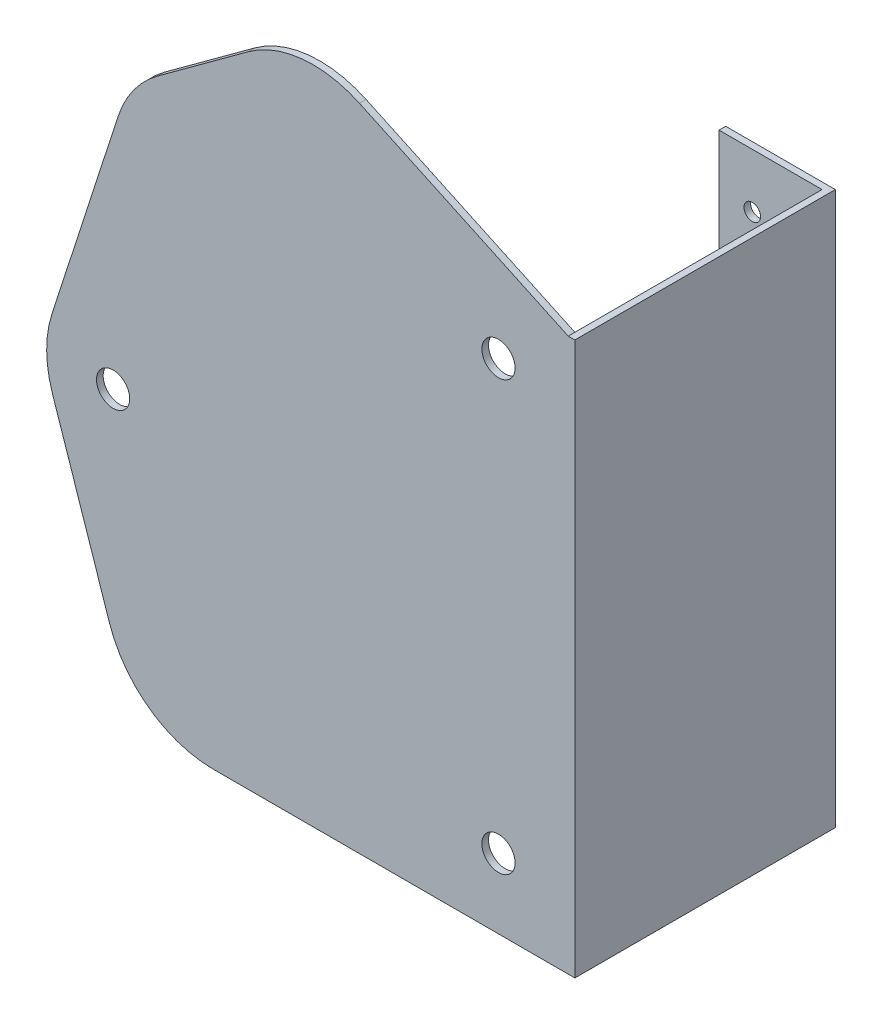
ISO-10303-21;
HEADER;
FILE_DESCRIPTION(('STEP AP214'),'2;1');
FILE_NAME('part.step','',(''),(''),'','','');
FILE_SCHEMA(('AUTOMOTIVE_DESIGN { 1 0 10303 214 1 1 1 1 }'));
ENDSEC;
DATA;
#1=APPLICATION_CONTEXT('core data for automotive mechanical design processes');
#2=APPLICATION_PROTOCOL_DEFINITION('international standard','automotive_design',2000,#1);
#3=PRODUCT_CONTEXT('',#1,'mechanical');
#4=PRODUCT('Part','Part','',(#3));
#5=PRODUCT_RELATED_PRODUCT_CATEGORY('part','',(#4));
#6=PRODUCT_DEFINITION_FORMATION('','',#4);
#7=PRODUCT_DEFINITION_CONTEXT('part definition',#1,'design');
#8=PRODUCT_DEFINITION('design','',#6,#7);
#9=PRODUCT_DEFINITION_SHAPE('','',#8);
#10=(LENGTH_UNIT() NAMED_UNIT(*) SI_UNIT(.MILLI.,.METRE.));
#11=(NAMED_UNIT(*) PLANE_ANGLE_UNIT() SI_UNIT($,.RADIAN.));
#12=(NAMED_UNIT(*) SI_UNIT($,.STERADIAN.) SOLID_ANGLE_UNIT());
#13=UNCERTAINTY_MEASURE_WITH_UNIT(LENGTH_MEASURE(1.E-05),#10,'distance_accuracy_value','');
#14=(GEOMETRIC_REPRESENTATION_CONTEXT(3) GLOBAL_UNCERTAINTY_ASSIGNED_CONTEXT((#13)) GLOBAL_UNIT_ASSIGNED_CONTEXT((#10,
#11,#12)) REPRESENTATION_CONTEXT('',''));
#15=CARTESIAN_POINT('',(0.,0.,0.));
#16=DIRECTION('',(0.,0.,1.));
#17=DIRECTION('',(1.,0.,0.));
#18=AXIS2_PLACEMENT_3D('',#15,#16,#17);
#19=CARTESIAN_POINT('',(0.,166.333882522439,-76.4));
#20=DIRECTION('',(-1.,0.,0.));
#21=DIRECTION('',(0.,0.,1.));
#22=AXIS2_PLACEMENT_3D('',#19,#20,#21);
#23=PLANE('',#22);
#24=DIRECTION('',(0.,0.,1.));
#25=VECTOR('',#24,1.);
#26=CARTESIAN_POINT('',(0.,166.333882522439,-76.4));
#27=LINE('',#26,#25);
#28=CARTESIAN_POINT('',(0.,166.333882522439,-74.4));
#29=VERTEX_POINT('',#28);
#30=CARTESIAN_POINT('',(0.,166.333882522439,0.));
#31=VERTEX_POINT('',#30);
#32=EDGE_CURVE('E57',#29,#31,#27,.T.);
#33=ORIENTED_EDGE('',*,*,#32,.F.);
#34=DIRECTION('',(0.,1.,0.));
#35=VECTOR('',#34,1.);
#36=CARTESIAN_POINT('',(0.,0.,-74.4));
#37=LINE('',#36,#35);
#38=CARTESIAN_POINT('',(0.,0.,-74.4));
#39=VERTEX_POINT('',#38);
#40=EDGE_CURVE('E52',#39,#29,#37,.T.);
#41=ORIENTED_EDGE('',*,*,#40,.F.);
#42=DIRECTION('',(0.,0.,1.));
#43=VECTOR('',#42,1.);
#44=CARTESIAN_POINT('',(0.,0.,-76.4));
#45=LINE('',#44,#43);
#46=CARTESIAN_POINT('',(0.,0.,0.));
#47=VERTEX_POINT('',#46);
#48=EDGE_CURVE('E38',#39,#47,#45,.T.);
#49=ORIENTED_EDGE('',*,*,#48,.T.);
#50=DIRECTION('',(0.,1.,0.));
#51=VECTOR('',#50,1.);
#52=CARTESIAN_POINT('',(0.,0.,0.));
#53=LINE('',#52,#51);
#54=EDGE_CURVE('E197',#47,#31,#53,.T.);
#55=ORIENTED_EDGE('',*,*,#54,.T.);
#56=EDGE_LOOP('',(#33,#41,#49,#55));
#57=FACE_BOUND('',#56,.T.);
#58=ADVANCED_FACE('F34',(#57),#23,.T.);
#59=CARTESIAN_POINT('',(-19.0672172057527,175.214504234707,2.));
#60=DIRECTION('',(-0.422205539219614,-0.906500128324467,0.));
#61=DIRECTION('',(0.906500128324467,-0.422205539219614,0.));
#62=AXIS2_PLACEMENT_3D('',#59,#60,#61);
#63=PLANE('',#62);
#64=DIRECTION('',(-0.906500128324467,0.422205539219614,0.));
#65=VECTOR('',#64,1.);
#66=CARTESIAN_POINT('',(-19.0672172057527,175.214504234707,0.));
#67=LINE('',#66,#65);
#68=CARTESIAN_POINT('',(-62.8672172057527,195.614504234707,0.));
#69=VERTEX_POINT('',#68);
#70=EDGE_CURVE('E201',#31,#69,#67,.T.);
#71=ORIENTED_EDGE('',*,*,#70,.T.);
#72=DIRECTION('',(0.,0.,-1.));
#73=VECTOR('',#72,1.);
#74=CARTESIAN_POINT('',(-62.8672172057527,195.614504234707,2.));
#75=LINE('',#74,#73);
#76=CARTESIAN_POINT('',(-62.8672172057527,195.614504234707,2.));
#77=VERTEX_POINT('',#76);
#78=EDGE_CURVE('E44',#77,#69,#75,.T.);
#79=ORIENTED_EDGE('',*,*,#78,.F.);
#80=DIRECTION('',(-0.906500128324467,0.422205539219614,0.));
#81=VECTOR('',#80,1.);
#82=CARTESIAN_POINT('',(0.,166.333882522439,2.));
#83=LINE('',#82,#81);
#84=CARTESIAN_POINT('',(0.,166.333882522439,2.));
#85=VERTEX_POINT('',#84);
#86=EDGE_CURVE('E207',#85,#77,#83,.T.);
#87=ORIENTED_EDGE('',*,*,#86,.F.);
#88=DIRECTION('',(0.,0.,-1.));
#89=VECTOR('',#88,1.);
#90=CARTESIAN_POINT('',(0.,166.333882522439,2.));
#91=LINE('',#90,#89);
#92=EDGE_CURVE('E11',#85,#31,#91,.T.);
#93=ORIENTED_EDGE('',*,*,#92,.T.);
#94=EDGE_LOOP('',(#71,#79,#87,#93));
#95=FACE_BOUND('',#94,.T.);
#96=ADVANCED_FACE('F36',(#95),#63,.F.);
#97=CARTESIAN_POINT('',(-76.8,165.7,2.));
#98=DIRECTION('',(0.,0.,-1.));
#99=DIRECTION('',(-1.,0.,0.));
#100=AXIS2_PLACEMENT_3D('',#97,#98,#99);
#101=CYLINDRICAL_SURFACE('',#100,33.);
#102=CARTESIAN_POINT('',(-76.8,165.7,0.));
#103=DIRECTION('',(0.,0.,1.));
#104=DIRECTION('',(1.,0.,0.));
#105=AXIS2_PLACEMENT_3D('',#102,#103,#104);
#106=CIRCLE('',#105,33.);
#107=CARTESIAN_POINT('',(-96.3023165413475,192.320662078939,0.));
#108=VERTEX_POINT('',#107);
#109=EDGE_CURVE('E203',#69,#108,#106,.T.);
#110=ORIENTED_EDGE('',*,*,#109,.T.);
#111=DIRECTION('',(0.,0.,-1.));
#112=VECTOR('',#111,1.);
#113=CARTESIAN_POINT('',(-96.3023165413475,192.320662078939,2.));
#114=LINE('',#113,#112);
#115=CARTESIAN_POINT('',(-96.3023165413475,192.320662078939,2.));
#116=VERTEX_POINT('',#115);
#117=EDGE_CURVE('E232',#116,#108,#114,.T.);
#118=ORIENTED_EDGE('',*,*,#117,.F.);
#119=CARTESIAN_POINT('',(-76.8,165.7,2.));
#120=DIRECTION('',(0.,0.,1.));
#121=DIRECTION('',(1.,0.,0.));
#122=AXIS2_PLACEMENT_3D('',#119,#120,#121);
#123=CIRCLE('',#122,33.);
#124=EDGE_CURVE('E242',#77,#116,#123,.T.);
#125=ORIENTED_EDGE('',*,*,#124,.F.);
#126=ORIENTED_EDGE('',*,*,#78,.T.);
#127=EDGE_LOOP('',(#110,#118,#125,#126));
#128=FACE_BOUND('',#127,.T.);
#129=ADVANCED_FACE('F240',(#128),#101,.T.);
#130=CARTESIAN_POINT('',(-96.3023165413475,192.320662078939,2.));
#131=DIRECTION('',(0.590979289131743,-0.806686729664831,0.));
#132=DIRECTION('',(0.806686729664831,0.590979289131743,0.));
#133=AXIS2_PLACEMENT_3D('',#130,#131,#132);
#134=PLANE('',#133);
#135=DIRECTION('',(-0.80668672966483,-0.590979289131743,0.));
#136=VECTOR('',#135,1.);
#137=CARTESIAN_POINT('',(-96.3023165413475,192.320662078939,0.));
#138=LINE('',#137,#136);
#139=CARTESIAN_POINT('',(-123.602316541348,172.320662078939,0.));
#140=VERTEX_POINT('',#139);
#141=EDGE_CURVE('E250',#108,#140,#138,.T.);
#142=ORIENTED_EDGE('',*,*,#141,.T.);
#143=DIRECTION('',(0.,0.,-1.));
#144=VECTOR('',#143,1.);
#145=CARTESIAN_POINT('',(-123.602316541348,172.320662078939,2.));
#146=LINE('',#145,#144);
#147=CARTESIAN_POINT('',(-123.602316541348,172.320662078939,2.));
#148=VERTEX_POINT('',#147);
#149=EDGE_CURVE('E229',#148,#140,#146,.T.);
#150=ORIENTED_EDGE('',*,*,#149,.F.);
#151=DIRECTION('',(-0.80668672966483,-0.590979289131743,0.));
#152=VECTOR('',#151,1.);
#153=CARTESIAN_POINT('',(-96.3023165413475,192.320662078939,2.));
#154=LINE('',#153,#152);
#155=EDGE_CURVE('E294',#116,#148,#154,.T.);
#156=ORIENTED_EDGE('',*,*,#155,.F.);
#157=ORIENTED_EDGE('',*,*,#117,.T.);
#158=EDGE_LOOP('',(#142,#150,#156,#157));
#159=FACE_BOUND('',#158,.T.);
#160=ADVANCED_FACE('F314',(#159),#134,.F.);
#161=CARTESIAN_POINT('',(-104.1,145.7,2.));
#162=DIRECTION('',(0.,0.,-1.));
#163=DIRECTION('',(-1.,0.,0.));
#164=AXIS2_PLACEMENT_3D('',#161,#162,#163);
#165=CYLINDRICAL_SURFACE('',#164,33.);
#166=CARTESIAN_POINT('',(-104.1,145.7,0.));
#167=DIRECTION('',(0.,0.,1.));
#168=DIRECTION('',(1.,0.,0.));
#169=AXIS2_PLACEMENT_3D('',#166,#167,#168);
#170=CIRCLE('',#169,33.);
#171=CARTESIAN_POINT('',(-135.492379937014,155.874403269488,0.));
#172=VERTEX_POINT('',#171);
#173=EDGE_CURVE('E252',#140,#172,#170,.T.);
#174=ORIENTED_EDGE('',*,*,#173,.T.);
#175=DIRECTION('',(0.,0.,-1.));
#176=VECTOR('',#175,1.);
#177=CARTESIAN_POINT('',(-135.492379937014,155.874403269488,2.));
#178=LINE('',#177,#176);
#179=CARTESIAN_POINT('',(-135.492379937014,155.874403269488,2.));
#180=VERTEX_POINT('',#179);
#181=EDGE_CURVE('E226',#180,#172,#178,.T.);
#182=ORIENTED_EDGE('',*,*,#181,.F.);
#183=CARTESIAN_POINT('',(-104.1,145.7,2.));
#184=DIRECTION('',(0.,0.,1.));
#185=DIRECTION('',(1.,0.,0.));
#186=AXIS2_PLACEMENT_3D('',#183,#184,#185);
#187=CIRCLE('',#186,33.);
#188=EDGE_CURVE('E296',#148,#180,#187,.T.);
#189=ORIENTED_EDGE('',*,*,#188,.F.);
#190=ORIENTED_EDGE('',*,*,#149,.T.);
#191=EDGE_LOOP('',(#174,#182,#189,#190));
#192=FACE_BOUND('',#191,.T.);
#193=ADVANCED_FACE('F318',(#192),#165,.T.);
#194=CARTESIAN_POINT('',(-135.492379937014,155.874403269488,2.));
#195=DIRECTION('',(0.95128424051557,-0.308315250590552,0.));
#196=DIRECTION('',(0.308315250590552,0.95128424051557,0.));
#197=AXIS2_PLACEMENT_3D('',#194,#195,#196);
#198=PLANE('',#197);
#199=DIRECTION('',(-0.308315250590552,-0.95128424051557,0.));
#200=VECTOR('',#199,1.);
#201=CARTESIAN_POINT('',(-135.492379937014,155.874403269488,0.));
#202=LINE('',#201,#200);
#203=CARTESIAN_POINT('',(-155.392379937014,94.4744032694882,0.));
#204=VERTEX_POINT('',#203);
#205=EDGE_CURVE('E258',#172,#204,#202,.T.);
#206=ORIENTED_EDGE('',*,*,#205,.T.);
#207=DIRECTION('',(0.,0.,-1.));
#208=VECTOR('',#207,1.);
#209=CARTESIAN_POINT('',(-155.392379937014,94.4744032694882,2.));
#210=LINE('',#209,#208);
#211=CARTESIAN_POINT('',(-155.392379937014,94.4744032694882,2.));
#212=VERTEX_POINT('',#211);
#213=EDGE_CURVE('E223',#212,#204,#210,.T.);
#214=ORIENTED_EDGE('',*,*,#213,.F.);
#215=DIRECTION('',(-0.308315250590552,-0.95128424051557,0.));
#216=VECTOR('',#215,1.);
#217=CARTESIAN_POINT('',(-135.492379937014,155.874403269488,2.));
#218=LINE('',#217,#216);
#219=EDGE_CURVE('E298',#180,#212,#218,.T.);
#220=ORIENTED_EDGE('',*,*,#219,.F.);
#221=ORIENTED_EDGE('',*,*,#181,.T.);
#222=EDGE_LOOP('',(#206,#214,#220,#221));
#223=FACE_BOUND('',#222,.T.);
#224=ADVANCED_FACE('F324',(#223),#198,.F.);
#225=CARTESIAN_POINT('',(-124.,84.3,2.));
#226=DIRECTION('',(0.,0.,-1.));
#227=DIRECTION('',(-1.,0.,0.));
#228=AXIS2_PLACEMENT_3D('',#225,#226,#227);
#229=CYLINDRICAL_SURFACE('',#228,33.);
#230=CARTESIAN_POINT('',(-124.,84.3,0.));
#231=DIRECTION('',(0.,0.,1.));
#232=DIRECTION('',(1.,0.,0.));
#233=AXIS2_PLACEMENT_3D('',#230,#231,#232);
#234=CIRCLE('',#233,33.);
#235=CARTESIAN_POINT('',(-155.288203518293,73.8096081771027,0.));
#236=VERTEX_POINT('',#235);
#237=EDGE_CURVE('E260',#204,#236,#234,.T.);
#238=ORIENTED_EDGE('',*,*,#237,.T.);
#239=DIRECTION('',(0.,0.,-1.));
#240=VECTOR('',#239,1.);
#241=CARTESIAN_POINT('',(-155.288203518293,73.8096081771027,2.));
#242=LINE('',#241,#240);
#243=CARTESIAN_POINT('',(-155.288203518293,73.8096081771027,2.));
#244=VERTEX_POINT('',#243);
#245=EDGE_CURVE('E220',#244,#236,#242,.T.);
#246=ORIENTED_EDGE('',*,*,#245,.F.);
#247=CARTESIAN_POINT('',(-124.,84.3,2.));
#248=DIRECTION('',(0.,0.,1.));
#249=DIRECTION('',(1.,0.,0.));
#250=AXIS2_PLACEMENT_3D('',#247,#248,#249);
#251=CIRCLE('',#250,33.);
#252=EDGE_CURVE('E300',#212,#244,#251,.T.);
#253=ORIENTED_EDGE('',*,*,#252,.F.);
#254=ORIENTED_EDGE('',*,*,#213,.T.);
#255=EDGE_LOOP('',(#238,#246,#253,#254));
#256=FACE_BOUND('',#255,.T.);
#257=ADVANCED_FACE('F328',(#256),#229,.T.);
#258=CARTESIAN_POINT('',(-155.288203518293,73.8096081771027,2.));
#259=DIRECTION('',(0.948127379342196,0.317890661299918,0.));
#260=DIRECTION('',(-0.317890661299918,0.948127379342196,0.));
#261=AXIS2_PLACEMENT_3D('',#258,#259,#260);
#262=PLANE('',#261);
#263=DIRECTION('',(0.317890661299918,-0.948127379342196,0.));
#264=VECTOR('',#263,1.);
#265=CARTESIAN_POINT('',(-155.288203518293,73.8096081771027,0.));
#266=LINE('',#265,#264);
#267=CARTESIAN_POINT('',(-138.088203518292,22.5096081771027,0.));
#268=VERTEX_POINT('',#267);
#269=EDGE_CURVE('E261',#236,#268,#266,.T.);
#270=ORIENTED_EDGE('',*,*,#269,.T.);
#271=DIRECTION('',(0.,0.,-1.));
#272=VECTOR('',#271,1.);
#273=CARTESIAN_POINT('',(-138.088203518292,22.5096081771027,2.));
#274=LINE('',#273,#272);
#275=CARTESIAN_POINT('',(-138.088203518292,22.5096081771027,2.));
#276=VERTEX_POINT('',#275);
#277=EDGE_CURVE('E216',#276,#268,#274,.T.);
#278=ORIENTED_EDGE('',*,*,#277,.F.);
#279=DIRECTION('',(0.317890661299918,-0.948127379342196,0.));
#280=VECTOR('',#279,1.);
#281=CARTESIAN_POINT('',(-155.288203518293,73.8096081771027,2.));
#282=LINE('',#281,#280);
#283=EDGE_CURVE('E302',#244,#276,#282,.T.);
#284=ORIENTED_EDGE('',*,*,#283,.F.);
#285=ORIENTED_EDGE('',*,*,#245,.T.);
#286=EDGE_LOOP('',(#270,#278,#284,#285));
#287=FACE_BOUND('',#286,.T.);
#288=ADVANCED_FACE('F330',(#287),#262,.F.);
#289=CARTESIAN_POINT('',(-106.8,33.,2.));
#290=DIRECTION('',(0.,0.,-1.));
#291=DIRECTION('',(-1.,0.,0.));
#292=AXIS2_PLACEMENT_3D('',#289,#290,#291);
#293=CYLINDRICAL_SURFACE('',#292,33.);
#294=CARTESIAN_POINT('',(-106.8,33.,0.));
#295=DIRECTION('',(0.,0.,1.));
#296=DIRECTION('',(1.,0.,0.));
#297=AXIS2_PLACEMENT_3D('',#294,#295,#296);
#298=CIRCLE('',#297,33.);
#299=CARTESIAN_POINT('',(-106.8,0.,0.));
#300=VERTEX_POINT('',#299);
#301=EDGE_CURVE('E198',#268,#300,#298,.T.);
#302=ORIENTED_EDGE('',*,*,#301,.T.);
#303=DIRECTION('',(0.,0.,-1.));
#304=VECTOR('',#303,1.);
#305=CARTESIAN_POINT('',(-106.8,0.,2.));
#306=LINE('',#305,#304);
#307=CARTESIAN_POINT('',(-106.8,0.,2.));
#308=VERTEX_POINT('',#307);
#309=EDGE_CURVE('E213',#308,#300,#306,.T.);
#310=ORIENTED_EDGE('',*,*,#309,.F.);
#311=CARTESIAN_POINT('',(-106.8,33.,2.));
#312=DIRECTION('',(0.,0.,1.));
#313=DIRECTION('',(1.,0.,0.));
#314=AXIS2_PLACEMENT_3D('',#311,#312,#313);
#315=CIRCLE('',#314,33.);
#316=EDGE_CURVE('E303',#276,#308,#315,.T.);
#317=ORIENTED_EDGE('',*,*,#316,.F.);
#318=ORIENTED_EDGE('',*,*,#277,.T.);
#319=EDGE_LOOP('',(#302,#310,#317,#318));
#320=FACE_BOUND('',#319,.T.);
#321=ADVANCED_FACE('F268',(#320),#293,.T.);
#322=CARTESIAN_POINT('',(-106.8,0.,2.));
#323=DIRECTION('',(0.,1.,0.));
#324=DIRECTION('',(0.,0.,1.));
#325=AXIS2_PLACEMENT_3D('',#322,#323,#324);
#326=PLANE('',#325);
#327=DIRECTION('',(1.,0.,0.));
#328=VECTOR('',#327,1.);
#329=CARTESIAN_POINT('',(-106.8,0.,0.));
#330=LINE('',#329,#328);
#331=EDGE_CURVE('E195',#300,#47,#330,.T.);
#332=ORIENTED_EDGE('',*,*,#331,.T.);
#333=ORIENTED_EDGE('',*,*,#48,.F.);
#334=DIRECTION('',(1.,0.,0.));
#335=VECTOR('',#334,1.);
#336=CARTESIAN_POINT('',(-31.,0.,-74.4));
#337=LINE('',#336,#335);
#338=CARTESIAN_POINT('',(-31.,0.,-74.4));
#339=VERTEX_POINT('',#338);
#340=EDGE_CURVE('E157',#339,#39,#337,.T.);
#341=ORIENTED_EDGE('',*,*,#340,.F.);
#342=DIRECTION('',(0.,0.,1.));
#343=VECTOR('',#342,1.);
#344=CARTESIAN_POINT('',(-31.,0.,-76.4));
#345=LINE('',#344,#343);
#346=CARTESIAN_POINT('',(-31.,0.,-76.4));
#347=VERTEX_POINT('',#346);
#348=EDGE_CURVE('E153',#347,#339,#345,.T.);
#349=ORIENTED_EDGE('',*,*,#348,.F.);
#350=DIRECTION('',(1.,0.,0.));
#351=VECTOR('',#350,1.);
#352=CARTESIAN_POINT('',(0.,0.,-76.4));
#353=LINE('',#352,#351);
#354=CARTESIAN_POINT('',(2.00000000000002,0.,-76.4));
#355=VERTEX_POINT('',#354);
#356=EDGE_CURVE('E140',#347,#355,#353,.T.);
#357=ORIENTED_EDGE('',*,*,#356,.T.);
#358=DIRECTION('',(0.,0.,1.));
#359=VECTOR('',#358,1.);
#360=CARTESIAN_POINT('',(2.00000000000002,0.,-76.4));
#361=LINE('',#360,#359);
#362=CARTESIAN_POINT('',(2.00000000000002,0.,2.));
#363=VERTEX_POINT('',#362);
#364=EDGE_CURVE('E272',#355,#363,#361,.T.);
#365=ORIENTED_EDGE('',*,*,#364,.T.);
#366=DIRECTION('',(1.,0.,0.));
#367=VECTOR('',#366,1.);
#368=CARTESIAN_POINT('',(-106.8,0.,2.));
#369=LINE('',#368,#367);
#370=EDGE_CURVE('E217',#308,#363,#369,.T.);
#371=ORIENTED_EDGE('',*,*,#370,.F.);
#372=ORIENTED_EDGE('',*,*,#309,.T.);
#373=EDGE_LOOP('',(#332,#333,#341,#349,#357,#365,#371,#372));
#374=FACE_BOUND('',#373,.T.);
#375=ADVANCED_FACE('F155',(#374),#326,.F.);
#376=CARTESIAN_POINT('',(-76.8,165.7,2.));
#377=DIRECTION('',(0.,0.,1.));
#378=DIRECTION('',(1.,0.,0.));
#379=AXIS2_PLACEMENT_3D('',#376,#377,#378);
#380=PLANE('',#379);
#381=CARTESIAN_POINT('',(-137.,84.,2.));
#382=DIRECTION('',(0.,0.,1.));
#383=DIRECTION('',(1.,0.,0.));
#384=AXIS2_PLACEMENT_3D('',#381,#382,#383);
#385=CIRCLE('',#384,4.99999999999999);
#386=CARTESIAN_POINT('',(-132.,84.,2.));
#387=VERTEX_POINT('',#386);
#388=EDGE_CURVE('E192',#387,#387,#385,.T.);
#389=ORIENTED_EDGE('',*,*,#388,.F.);
#390=EDGE_LOOP('',(#389));
#391=FACE_BOUND('',#390,.T.);
#392=CARTESIAN_POINT('',(-21.,150.,2.));
#393=DIRECTION('',(0.,0.,1.));
#394=DIRECTION('',(1.,0.,0.));
#395=AXIS2_PLACEMENT_3D('',#392,#393,#394);
#396=CIRCLE('',#395,5.);
#397=CARTESIAN_POINT('',(-16.,150.,2.));
#398=VERTEX_POINT('',#397);
#399=EDGE_CURVE('E279',#398,#398,#396,.T.);
#400=ORIENTED_EDGE('',*,*,#399,.F.);
#401=EDGE_LOOP('',(#400));
#402=FACE_BOUND('',#401,.T.);
#403=CARTESIAN_POINT('',(-21.,21.,2.));
#404=DIRECTION('',(0.,0.,1.));
#405=DIRECTION('',(1.,0.,0.));
#406=AXIS2_PLACEMENT_3D('',#403,#404,#405);
#407=CIRCLE('',#406,5.);
#408=CARTESIAN_POINT('',(-16.,21.,2.));
#409=VERTEX_POINT('',#408);
#410=EDGE_CURVE('E285',#409,#409,#407,.T.);
#411=ORIENTED_EDGE('',*,*,#410,.F.);
#412=EDGE_LOOP('',(#411));
#413=FACE_BOUND('',#412,.T.);
#414=ORIENTED_EDGE('',*,*,#370,.T.);
#415=DIRECTION('',(0.,1.,0.));
#416=VECTOR('',#415,1.);
#417=CARTESIAN_POINT('',(2.,166.333882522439,2.));
#418=LINE('',#417,#416);
#419=CARTESIAN_POINT('',(2.,166.333882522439,2.));
#420=VERTEX_POINT('',#419);
#421=EDGE_CURVE('E178',#363,#420,#418,.T.);
#422=ORIENTED_EDGE('',*,*,#421,.T.);
#423=DIRECTION('',(-1.,0.,0.));
#424=VECTOR('',#423,1.);
#425=CARTESIAN_POINT('',(0.,166.333882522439,2.));
#426=LINE('',#425,#424);
#427=EDGE_CURVE('E150',#420,#85,#426,.T.);
#428=ORIENTED_EDGE('',*,*,#427,.T.);
#429=ORIENTED_EDGE('',*,*,#86,.T.);
#430=ORIENTED_EDGE('',*,*,#124,.T.);
#431=ORIENTED_EDGE('',*,*,#155,.T.);
#432=ORIENTED_EDGE('',*,*,#188,.T.);
#433=ORIENTED_EDGE('',*,*,#219,.T.);
#434=ORIENTED_EDGE('',*,*,#252,.T.);
#435=ORIENTED_EDGE('',*,*,#283,.T.);
#436=ORIENTED_EDGE('',*,*,#316,.T.);
#437=EDGE_LOOP('',(#414,#422,#428,#429,#430,#431,#432,#433,#434,#435,#436));
#438=FACE_BOUND('',#437,.T.);
#439=ADVANCED_FACE('F305',(#391,#402,#413,#438),#380,.T.);
#440=CARTESIAN_POINT('',(-76.8,165.7,0.));
#441=DIRECTION('',(0.,0.,1.));
#442=DIRECTION('',(1.,0.,0.));
#443=AXIS2_PLACEMENT_3D('',#440,#441,#442);
#444=PLANE('',#443);
#445=CARTESIAN_POINT('',(-137.,84.,0.));
#446=DIRECTION('',(0.,0.,1.));
#447=DIRECTION('',(1.,0.,0.));
#448=AXIS2_PLACEMENT_3D('',#445,#446,#447);
#449=CIRCLE('',#448,4.99999999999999);
#450=CARTESIAN_POINT('',(-132.,84.,0.));
#451=VERTEX_POINT('',#450);
#452=EDGE_CURVE('E276',#451,#451,#449,.T.);
#453=ORIENTED_EDGE('',*,*,#452,.T.);
#454=EDGE_LOOP('',(#453));
#455=FACE_BOUND('',#454,.T.);
#456=CARTESIAN_POINT('',(-21.,150.,0.));
#457=DIRECTION('',(0.,0.,1.));
#458=DIRECTION('',(1.,0.,0.));
#459=AXIS2_PLACEMENT_3D('',#456,#457,#458);
#460=CIRCLE('',#459,5.);
#461=CARTESIAN_POINT('',(-16.,150.,0.));
#462=VERTEX_POINT('',#461);
#463=EDGE_CURVE('E282',#462,#462,#460,.T.);
#464=ORIENTED_EDGE('',*,*,#463,.T.);
#465=EDGE_LOOP('',(#464));
#466=FACE_BOUND('',#465,.T.);
#467=CARTESIAN_POINT('',(-21.,21.,0.));
#468=DIRECTION('',(0.,0.,1.));
#469=DIRECTION('',(1.,0.,0.));
#470=AXIS2_PLACEMENT_3D('',#467,#468,#469);
#471=CIRCLE('',#470,5.);
#472=CARTESIAN_POINT('',(-16.,21.,0.));
#473=VERTEX_POINT('',#472);
#474=EDGE_CURVE('E204',#473,#473,#471,.T.);
#475=ORIENTED_EDGE('',*,*,#474,.T.);
#476=EDGE_LOOP('',(#475));
#477=FACE_BOUND('',#476,.T.);
#478=ORIENTED_EDGE('',*,*,#70,.F.);
#479=ORIENTED_EDGE('',*,*,#54,.F.);
#480=ORIENTED_EDGE('',*,*,#331,.F.);
#481=ORIENTED_EDGE('',*,*,#301,.F.);
#482=ORIENTED_EDGE('',*,*,#269,.F.);
#483=ORIENTED_EDGE('',*,*,#237,.F.);
#484=ORIENTED_EDGE('',*,*,#205,.F.);
#485=ORIENTED_EDGE('',*,*,#173,.F.);
#486=ORIENTED_EDGE('',*,*,#141,.F.);
#487=ORIENTED_EDGE('',*,*,#109,.F.);
#488=EDGE_LOOP('',(#478,#479,#480,#481,#482,#483,#484,#485,#486,#487));
#489=FACE_BOUND('',#488,.T.);
#490=ADVANCED_FACE('F247',(#455,#466,#477,#489),#444,.F.);
#491=CARTESIAN_POINT('',(-21.,21.,0.));
#492=DIRECTION('',(0.,0.,1.));
#493=DIRECTION('',(1.,0.,0.));
#494=AXIS2_PLACEMENT_3D('',#491,#492,#493);
#495=CYLINDRICAL_SURFACE('',#494,5.);
#496=ORIENTED_EDGE('',*,*,#474,.F.);
#497=EDGE_LOOP('',(#496));
#498=FACE_BOUND('',#497,.T.);
#499=ORIENTED_EDGE('',*,*,#410,.T.);
#500=EDGE_LOOP('',(#499));
#501=FACE_BOUND('',#500,.T.);
#502=ADVANCED_FACE('F355',(#498,#501),#495,.F.);
#503=CARTESIAN_POINT('',(-21.,150.,0.));
#504=DIRECTION('',(0.,0.,1.));
#505=DIRECTION('',(1.,0.,0.));
#506=AXIS2_PLACEMENT_3D('',#503,#504,#505);
#507=CYLINDRICAL_SURFACE('',#506,5.);
#508=ORIENTED_EDGE('',*,*,#463,.F.);
#509=EDGE_LOOP('',(#508));
#510=FACE_BOUND('',#509,.T.);
#511=ORIENTED_EDGE('',*,*,#399,.T.);
#512=EDGE_LOOP('',(#511));
#513=FACE_BOUND('',#512,.T.);
#514=ADVANCED_FACE('F351',(#510,#513),#507,.F.);
#515=CARTESIAN_POINT('',(-137.,84.,0.));
#516=DIRECTION('',(0.,0.,1.));
#517=DIRECTION('',(1.,0.,0.));
#518=AXIS2_PLACEMENT_3D('',#515,#516,#517);
#519=CYLINDRICAL_SURFACE('',#518,4.99999999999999);
#520=ORIENTED_EDGE('',*,*,#452,.F.);
#521=EDGE_LOOP('',(#520));
#522=FACE_BOUND('',#521,.T.);
#523=ORIENTED_EDGE('',*,*,#388,.T.);
#524=EDGE_LOOP('',(#523));
#525=FACE_BOUND('',#524,.T.);
#526=ADVANCED_FACE('F348',(#522,#525),#519,.F.);
#527=CARTESIAN_POINT('',(0.,166.333882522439,-76.4));
#528=DIRECTION('',(0.,1.,0.));
#529=DIRECTION('',(0.,0.,1.));
#530=AXIS2_PLACEMENT_3D('',#527,#528,#529);
#531=PLANE('',#530);
#532=ORIENTED_EDGE('',*,*,#427,.F.);
#533=DIRECTION('',(0.,0.,1.));
#534=VECTOR('',#533,1.);
#535=CARTESIAN_POINT('',(2.,166.333882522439,-76.4));
#536=LINE('',#535,#534);
#537=CARTESIAN_POINT('',(2.,166.333882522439,-76.4));
#538=VERTEX_POINT('',#537);
#539=EDGE_CURVE('E189',#538,#420,#536,.T.);
#540=ORIENTED_EDGE('',*,*,#539,.F.);
#541=DIRECTION('',(-1.,0.,0.));
#542=VECTOR('',#541,1.);
#543=CARTESIAN_POINT('',(0.,166.333882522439,-76.4));
#544=LINE('',#543,#542);
#545=CARTESIAN_POINT('',(-31.,166.333882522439,-76.4));
#546=VERTEX_POINT('',#545);
#547=EDGE_CURVE('E181',#538,#546,#544,.T.);
#548=ORIENTED_EDGE('',*,*,#547,.T.);
#549=DIRECTION('',(0.,0.,-1.));
#550=VECTOR('',#549,1.);
#551=CARTESIAN_POINT('',(-31.,166.333882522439,-76.4));
#552=LINE('',#551,#550);
#553=CARTESIAN_POINT('',(-31.,166.333882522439,-74.4));
#554=VERTEX_POINT('',#553);
#555=EDGE_CURVE('E165',#554,#546,#552,.T.);
#556=ORIENTED_EDGE('',*,*,#555,.F.);
#557=DIRECTION('',(1.,0.,0.));
#558=VECTOR('',#557,1.);
#559=CARTESIAN_POINT('',(-31.,166.333882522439,-74.4));
#560=LINE('',#559,#558);
#561=EDGE_CURVE('E174',#554,#29,#560,.T.);
#562=ORIENTED_EDGE('',*,*,#561,.T.);
#563=ORIENTED_EDGE('',*,*,#32,.T.);
#564=ORIENTED_EDGE('',*,*,#92,.F.);
#565=EDGE_LOOP('',(#532,#540,#548,#556,#562,#563,#564));
#566=FACE_BOUND('',#565,.T.);
#567=ADVANCED_FACE('F310',(#566),#531,.T.);
#568=CARTESIAN_POINT('',(2.,166.333882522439,-76.4));
#569=DIRECTION('',(1.,0.,0.));
#570=DIRECTION('',(0.,1.,0.));
#571=AXIS2_PLACEMENT_3D('',#568,#569,#570);
#572=PLANE('',#571);
#573=ORIENTED_EDGE('',*,*,#421,.F.);
#574=ORIENTED_EDGE('',*,*,#364,.F.);
#575=DIRECTION('',(0.,1.,0.));
#576=VECTOR('',#575,1.);
#577=CARTESIAN_POINT('',(2.,166.333882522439,-76.4));
#578=LINE('',#577,#576);
#579=EDGE_CURVE('E147',#355,#538,#578,.T.);
#580=ORIENTED_EDGE('',*,*,#579,.T.);
#581=ORIENTED_EDGE('',*,*,#539,.T.);
#582=EDGE_LOOP('',(#573,#574,#580,#581));
#583=FACE_BOUND('',#582,.T.);
#584=ADVANCED_FACE('F346',(#583),#572,.T.);
#585=CARTESIAN_POINT('',(0.,0.,-76.4));
#586=DIRECTION('',(0.,0.,1.));
#587=DIRECTION('',(1.,0.,0.));
#588=AXIS2_PLACEMENT_3D('',#585,#586,#587);
#589=PLANE('',#588);
#590=CARTESIAN_POINT('',(-21.,150.,-76.4));
#591=DIRECTION('',(0.,0.,1.));
#592=DIRECTION('',(1.,0.,0.));
#593=AXIS2_PLACEMENT_3D('',#590,#591,#592);
#594=CIRCLE('',#593,2.5);
#595=CARTESIAN_POINT('',(-18.5,150.,-76.4));
#596=VERTEX_POINT('',#595);
#597=EDGE_CURVE('E542',#596,#596,#594,.T.);
#598=ORIENTED_EDGE('',*,*,#597,.T.);
#599=EDGE_LOOP('',(#598));
#600=FACE_BOUND('',#599,.T.);
#601=CARTESIAN_POINT('',(-21.,21.,-76.4));
#602=DIRECTION('',(0.,0.,1.));
#603=DIRECTION('',(1.,0.,0.));
#604=AXIS2_PLACEMENT_3D('',#601,#602,#603);
#605=CIRCLE('',#604,2.5);
#606=CARTESIAN_POINT('',(-18.5,21.,-76.4));
#607=VERTEX_POINT('',#606);
#608=EDGE_CURVE('E167',#607,#607,#605,.T.);
#609=ORIENTED_EDGE('',*,*,#608,.T.);
#610=EDGE_LOOP('',(#609));
#611=FACE_BOUND('',#610,.T.);
#612=ORIENTED_EDGE('',*,*,#356,.F.);
#613=DIRECTION('',(0.,-1.,0.));
#614=VECTOR('',#613,1.);
#615=CARTESIAN_POINT('',(-31.,0.,-76.4));
#616=LINE('',#615,#614);
#617=EDGE_CURVE('E145',#546,#347,#616,.T.);
#618=ORIENTED_EDGE('',*,*,#617,.F.);
#619=ORIENTED_EDGE('',*,*,#547,.F.);
#620=ORIENTED_EDGE('',*,*,#579,.F.);
#621=EDGE_LOOP('',(#612,#618,#619,#620));
#622=FACE_BOUND('',#621,.T.);
#623=ADVANCED_FACE('F142',(#600,#611,#622),#589,.F.);
#624=CARTESIAN_POINT('',(-31.,0.,-74.4));
#625=DIRECTION('',(0.,0.,-1.));
#626=DIRECTION('',(-1.,0.,0.));
#627=AXIS2_PLACEMENT_3D('',#624,#625,#626);
#628=PLANE('',#627);
#629=CARTESIAN_POINT('',(-21.,150.,-74.4));
#630=DIRECTION('',(0.,0.,1.));
#631=DIRECTION('',(1.,0.,0.));
#632=AXIS2_PLACEMENT_3D('',#629,#630,#631);
#633=CIRCLE('',#632,2.5);
#634=CARTESIAN_POINT('',(-18.5,150.,-74.4));
#635=VERTEX_POINT('',#634);
#636=EDGE_CURVE('E545',#635,#635,#633,.T.);
#637=ORIENTED_EDGE('',*,*,#636,.F.);
#638=EDGE_LOOP('',(#637));
#639=FACE_BOUND('',#638,.T.);
#640=CARTESIAN_POINT('',(-21.,21.,-74.4));
#641=DIRECTION('',(0.,0.,1.));
#642=DIRECTION('',(1.,0.,0.));
#643=AXIS2_PLACEMENT_3D('',#640,#641,#642);
#644=CIRCLE('',#643,2.5);
#645=CARTESIAN_POINT('',(-18.5,21.,-74.4));
#646=VERTEX_POINT('',#645);
#647=EDGE_CURVE('E170',#646,#646,#644,.T.);
#648=ORIENTED_EDGE('',*,*,#647,.F.);
#649=EDGE_LOOP('',(#648));
#650=FACE_BOUND('',#649,.T.);
#651=ORIENTED_EDGE('',*,*,#40,.T.);
#652=ORIENTED_EDGE('',*,*,#561,.F.);
#653=DIRECTION('',(0.,1.,0.));
#654=VECTOR('',#653,1.);
#655=CARTESIAN_POINT('',(-31.,0.,-74.4));
#656=LINE('',#655,#654);
#657=EDGE_CURVE('E160',#339,#554,#656,.T.);
#658=ORIENTED_EDGE('',*,*,#657,.F.);
#659=ORIENTED_EDGE('',*,*,#340,.T.);
#660=EDGE_LOOP('',(#651,#652,#658,#659));
#661=FACE_BOUND('',#660,.T.);
#662=ADVANCED_FACE('F409',(#639,#650,#661),#628,.F.);
#663=CARTESIAN_POINT('',(-31.,0.,0.));
#664=DIRECTION('',(1.,0.,0.));
#665=DIRECTION('',(0.,0.,-1.));
#666=AXIS2_PLACEMENT_3D('',#663,#664,#665);
#667=PLANE('',#666);
#668=ORIENTED_EDGE('',*,*,#617,.T.);
#669=ORIENTED_EDGE('',*,*,#348,.T.);
#670=ORIENTED_EDGE('',*,*,#657,.T.);
#671=ORIENTED_EDGE('',*,*,#555,.T.);
#672=EDGE_LOOP('',(#668,#669,#670,#671));
#673=FACE_BOUND('',#672,.T.);
#674=ADVANCED_FACE('F163',(#673),#667,.F.);
#675=CARTESIAN_POINT('',(-21.,21.,-76.4));
#676=DIRECTION('',(0.,0.,1.));
#677=DIRECTION('',(1.,0.,0.));
#678=AXIS2_PLACEMENT_3D('',#675,#676,#677);
#679=CYLINDRICAL_SURFACE('',#678,2.5);
#680=ORIENTED_EDGE('',*,*,#608,.F.);
#681=EDGE_LOOP('',(#680));
#682=FACE_BOUND('',#681,.T.);
#683=ORIENTED_EDGE('',*,*,#647,.T.);
#684=EDGE_LOOP('',(#683));
#685=FACE_BOUND('',#684,.T.);
#686=ADVANCED_FACE('F424',(#682,#685),#679,.F.);
#687=CARTESIAN_POINT('',(-21.,150.,-76.4));
#688=DIRECTION('',(0.,0.,1.));
#689=DIRECTION('',(1.,0.,0.));
#690=AXIS2_PLACEMENT_3D('',#687,#688,#689);
#691=CYLINDRICAL_SURFACE('',#690,2.5);
#692=ORIENTED_EDGE('',*,*,#597,.F.);
#693=EDGE_LOOP('',(#692));
#694=FACE_BOUND('',#693,.T.);
#695=ORIENTED_EDGE('',*,*,#636,.T.);
#696=EDGE_LOOP('',(#695));
#697=FACE_BOUND('',#696,.T.);
#698=ADVANCED_FACE('F430',(#694,#697),#691,.F.);
#699=CLOSED_SHELL('',(#58,#96,#129,#160,#193,#224,#257,#288,#321,#375,#439,#490,#502,#514,#526,
#567,#584,#623,#662,#674,#686,#698));
#700=MANIFOLD_SOLID_BREP('B2',#699);
#701=ADVANCED_BREP_SHAPE_REPRESENTATION('',(#18,#700),#14);
#702=SHAPE_DEFINITION_REPRESENTATION(#9,#701);
ENDSEC;
END-ISO-10303-21;
